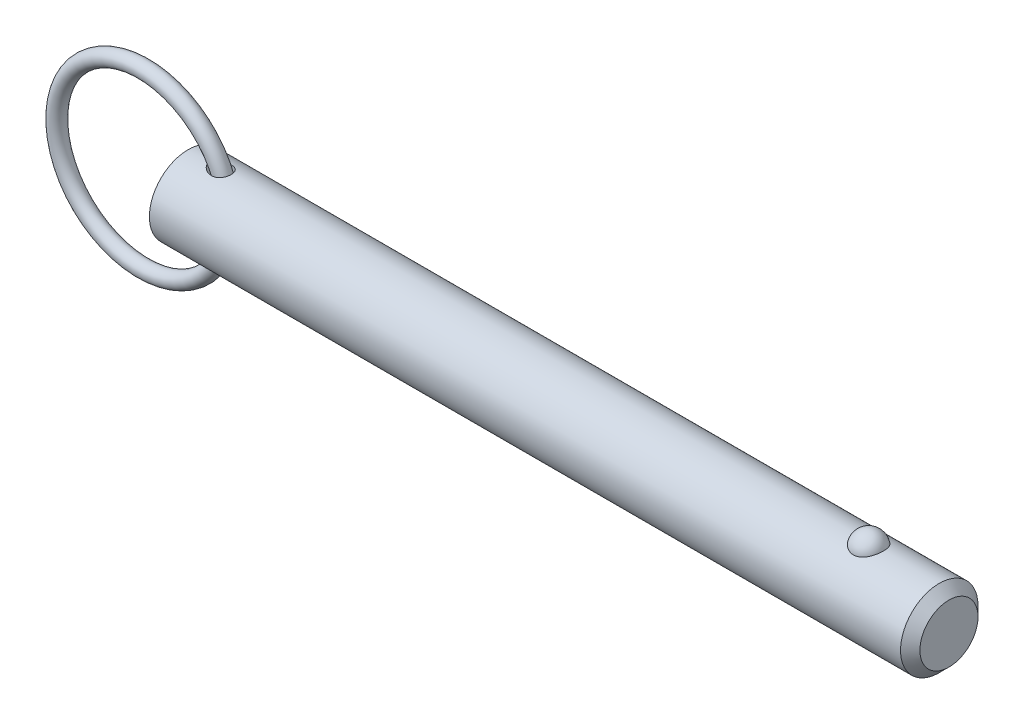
ISO-10303-21;
HEADER;
FILE_DESCRIPTION(('STEP AP214'),'2;1');
FILE_NAME('part.step','',(''),(''),'','','');
FILE_SCHEMA(('AUTOMOTIVE_DESIGN { 1 0 10303 214 1 1 1 1 }'));
ENDSEC;
DATA;
#1=APPLICATION_CONTEXT('core data for automotive mechanical design processes');
#2=APPLICATION_PROTOCOL_DEFINITION('international standard','automotive_design',2000,#1);
#3=PRODUCT_CONTEXT('',#1,'mechanical');
#4=PRODUCT('Part','Part','',(#3));
#5=PRODUCT_RELATED_PRODUCT_CATEGORY('part','',(#4));
#6=PRODUCT_DEFINITION_FORMATION('','',#4);
#7=PRODUCT_DEFINITION_CONTEXT('part definition',#1,'design');
#8=PRODUCT_DEFINITION('design','',#6,#7);
#9=PRODUCT_DEFINITION_SHAPE('','',#8);
#10=(LENGTH_UNIT() NAMED_UNIT(*) SI_UNIT(.MILLI.,.METRE.));
#11=(NAMED_UNIT(*) PLANE_ANGLE_UNIT() SI_UNIT($,.RADIAN.));
#12=(NAMED_UNIT(*) SI_UNIT($,.STERADIAN.) SOLID_ANGLE_UNIT());
#13=UNCERTAINTY_MEASURE_WITH_UNIT(LENGTH_MEASURE(1.E-05),#10,'distance_accuracy_value','');
#14=(GEOMETRIC_REPRESENTATION_CONTEXT(3) GLOBAL_UNCERTAINTY_ASSIGNED_CONTEXT((#13)) GLOBAL_UNIT_ASSIGNED_CONTEXT((#10,
#11,#12)) REPRESENTATION_CONTEXT('',''));
#15=CARTESIAN_POINT('',(0.,0.,0.));
#16=DIRECTION('',(0.,0.,1.));
#17=DIRECTION('',(1.,0.,0.));
#18=AXIS2_PLACEMENT_3D('',#15,#16,#17);
#19=CARTESIAN_POINT('',(-8.23730968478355,0.,0.));
#20=DIRECTION('',(0.,0.,1.));
#21=DIRECTION('',(1.,0.,0.));
#22=AXIS2_PLACEMENT_3D('',#19,#20,#21);
#23=TOROIDAL_SURFACE('',#22,15.875,1.422);
#24=CARTESIAN_POINT('',(9.05969031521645,0.,0.));
#25=VERTEX_POINT('',#24);
#26=VERTEX_LOOP('',#25);
#27=FACE_BOUND('',#26,.T.);
#28=ADVANCED_FACE('P0_F12',(#27),#23,.T.);
#29=CLOSED_SHELL('',(#28));
#30=MANIFOLD_SOLID_BREP('P0_B1',#29);
#31=CARTESIAN_POINT('',(0.,0.,0.));
#32=DIRECTION('',(1.,0.,0.));
#33=DIRECTION('',(0.,0.,-1.));
#34=AXIS2_PLACEMENT_3D('',#31,#32,#33);
#35=CYLINDRICAL_SURFACE('',#34,7.11);
#36=CARTESIAN_POINT('',(3.98467340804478,7.10072679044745,-0.363013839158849));
#37=CARTESIAN_POINT('',(4.00971652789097,7.09600153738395,-0.45539194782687));
#38=CARTESIAN_POINT('',(4.04401947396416,7.08958406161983,-0.545230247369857));
#39=CARTESIAN_POINT('',(4.12810160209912,7.07427055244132,-0.717157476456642));
#40=CARTESIAN_POINT('',(4.17791765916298,7.06536861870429,-0.799227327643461));
#41=CARTESIAN_POINT('',(4.28924471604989,7.04620300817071,-0.953469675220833));
#42=CARTESIAN_POINT('',(4.35063580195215,7.035953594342,-1.02573162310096));
#43=CARTESIAN_POINT('',(4.48282610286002,7.01493313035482,-1.16081412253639));
#44=CARTESIAN_POINT('',(4.55362244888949,7.00416223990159,-1.22363754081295));
#45=CARTESIAN_POINT('',(4.71659336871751,6.98090398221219,-1.35055080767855));
#46=CARTESIAN_POINT('',(4.81029272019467,6.96847103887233,-1.41269256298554));
#47=CARTESIAN_POINT('',(5.0057240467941,6.94515366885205,-1.52319699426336));
#48=CARTESIAN_POINT('',(5.10746392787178,6.93427079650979,-1.57154588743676));
#49=CARTESIAN_POINT('',(5.33503739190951,6.91346066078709,-1.66091325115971));
#50=CARTESIAN_POINT('',(5.46199550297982,6.90402388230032,-1.69921932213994));
#51=CARTESIAN_POINT('',(5.72084799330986,6.89024030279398,-1.75428261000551));
#52=CARTESIAN_POINT('',(5.85274301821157,6.88589416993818,-1.77103699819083));
#53=CARTESIAN_POINT('',(6.11557710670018,6.88337277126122,-1.78081990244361));
#54=CARTESIAN_POINT('',(6.24650031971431,6.88510489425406,-1.77420448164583));
#55=CARTESIAN_POINT('',(6.50446311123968,6.89478744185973,-1.73620392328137));
#56=CARTESIAN_POINT('',(6.6315075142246,6.90272978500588,-1.70485097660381));
#57=CARTESIAN_POINT('',(6.85933269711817,6.92243075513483,-1.62281888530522));
#58=CARTESIAN_POINT('',(6.96133251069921,6.93352131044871,-1.5753580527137));
#59=CARTESIAN_POINT('',(7.15436649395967,6.95824811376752,-1.46226310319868));
#60=CARTESIAN_POINT('',(7.24540699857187,6.97188287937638,-1.3966395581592));
#61=CARTESIAN_POINT('',(7.40446019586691,6.99838217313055,-1.25668991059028));
#62=CARTESIAN_POINT('',(7.473875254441,7.01118308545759,-1.18393777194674));
#63=CARTESIAN_POINT('',(7.59904891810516,7.03582803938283,-1.02736918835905));
#64=CARTESIAN_POINT('',(7.65481029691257,7.04767227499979,-0.943554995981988));
#65=CARTESIAN_POINT('',(7.74982438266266,7.06873077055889,-0.76979592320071));
#66=CARTESIAN_POINT('',(7.7894903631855,7.07800861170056,-0.680084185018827));
#67=CARTESIAN_POINT('',(7.85354088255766,7.09334756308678,-0.495102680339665));
#68=CARTESIAN_POINT('',(7.87792559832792,7.09940871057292,-0.399832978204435));
#69=CARTESIAN_POINT('',(7.9108898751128,7.10766731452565,-0.206294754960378));
#70=CARTESIAN_POINT('',(7.91944662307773,7.10985919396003,-0.108022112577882));
#71=CARTESIAN_POINT('',(7.920501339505,7.11012756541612,0.0886168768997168));
#72=CARTESIAN_POINT('',(7.91299895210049,7.10820396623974,0.186983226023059));
#73=CARTESIAN_POINT('',(7.88205794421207,7.10043733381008,0.381270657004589));
#74=CARTESIAN_POINT('',(7.85857985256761,7.09458459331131,0.477185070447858));
#75=CARTESIAN_POINT('',(7.79617406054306,7.07958431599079,0.663575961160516));
#76=CARTESIAN_POINT('',(7.75724672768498,7.07043685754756,0.754052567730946));
#77=CARTESIAN_POINT('',(7.66496731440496,7.04987259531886,0.926798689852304));
#78=CARTESIAN_POINT('',(7.61164530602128,7.0384605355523,1.00908483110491));
#79=CARTESIAN_POINT('',(7.49191707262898,7.01461776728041,1.16333092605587));
#80=CARTESIAN_POINT('',(7.42551210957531,7.00218715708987,1.235291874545));
#81=CARTESIAN_POINT('',(7.28164031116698,6.97770944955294,1.36680167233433));
#82=CARTESIAN_POINT('',(7.20420170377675,6.96566146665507,1.42638126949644));
#83=CARTESIAN_POINT('',(7.0403906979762,6.94319963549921,1.53199377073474));
#84=CARTESIAN_POINT('',(6.95401827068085,6.93278579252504,1.57802663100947));
#85=CARTESIAN_POINT('',(6.7731858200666,6.91444459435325,1.65656940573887));
#86=CARTESIAN_POINT('',(6.67860569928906,6.90656682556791,1.68881327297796));
#87=CARTESIAN_POINT('',(6.48544119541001,6.89422806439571,1.73849768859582));
#88=CARTESIAN_POINT('',(6.38685561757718,6.88976809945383,1.755933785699));
#89=CARTESIAN_POINT('',(6.18089829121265,6.88429907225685,1.77726234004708));
#90=CARTESIAN_POINT('',(6.07340937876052,6.88356485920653,1.78007646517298));
#91=CARTESIAN_POINT('',(5.85921220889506,6.886086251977,1.77029087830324));
#92=CARTESIAN_POINT('',(5.75250426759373,6.88934339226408,1.75768523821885));
#93=CARTESIAN_POINT('',(5.52848027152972,6.89994454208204,1.71563399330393));
#94=CARTESIAN_POINT('',(5.41155168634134,6.90775772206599,1.68424184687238));
#95=CARTESIAN_POINT('',(5.18376466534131,6.92670168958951,1.60454711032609));
#96=CARTESIAN_POINT('',(5.07291446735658,6.9378368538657,1.5562221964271));
#97=CARTESIAN_POINT('',(4.84835244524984,6.96347168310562,1.43744827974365));
#98=CARTESIAN_POINT('',(4.73562531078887,6.97820486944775,1.36517310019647));
#99=CARTESIAN_POINT('',(4.52504912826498,7.00822340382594,1.20158053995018));
#100=CARTESIAN_POINT('',(4.42717478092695,7.02350775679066,1.11029618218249));
#101=CARTESIAN_POINT('',(4.27935716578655,7.04784659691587,0.940654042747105));
#102=CARTESIAN_POINT('',(4.2239722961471,7.05736064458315,0.867099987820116));
#103=CARTESIAN_POINT('',(4.12558347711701,7.07469854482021,0.711919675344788));
#104=CARTESIAN_POINT('',(4.08256922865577,7.0825238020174,0.630300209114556));
#105=CARTESIAN_POINT('',(4.01142860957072,7.09565978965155,0.459428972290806));
#106=CARTESIAN_POINT('',(3.98346043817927,7.10094374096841,0.370107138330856));
#107=CARTESIAN_POINT('',(3.95517285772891,7.1063173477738,0.233358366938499));
#108=CARTESIAN_POINT('',(3.94802115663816,7.1076831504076,0.187321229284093));
#109=CARTESIAN_POINT('',(3.93842121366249,7.10951900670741,0.0947476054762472));
#110=CARTESIAN_POINT('',(3.93597129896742,7.10998937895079,0.0482113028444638));
#111=CARTESIAN_POINT('',(3.93584361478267,7.11001358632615,-0.0598597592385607));
#112=CARTESIAN_POINT('',(3.9399538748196,7.10922402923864,-0.121405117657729));
#113=CARTESIAN_POINT('',(3.95632793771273,7.10609781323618,-0.243320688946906));
#114=CARTESIAN_POINT('',(3.96859135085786,7.10376122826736,-0.303690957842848));
#115=CARTESIAN_POINT('',(3.98467340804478,7.10072679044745,-0.363013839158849));
#116=B_SPLINE_CURVE_WITH_KNOTS('',3,(#36,#37,#38,#39,#40,#41,#42,#43,#44,#45,#46,#47,#48,#49,
#50,#51,#52,#53,#54,#55,#56,#57,#58,#59,#60,#61,#62,#63,#64,#65,#66,#67,#68,#69,#70,#71,#72,#73,
#74,#75,#76,#77,#78,#79,#80,#81,#82,#83,#84,#85,#86,#87,#88,#89,#90,#91,#92,#93,#94,#95,#96,#97,
#98,#99,#100,#101,#102,#103,#104,#105,#106,#107,#108,#109,#110,#111,#112,#113,#114,#115),
.UNSPECIFIED.,.T.,.F.,(4,2,2,2,2,2,2,2,2,2,2,2,2,2,2,2,2,2,2,2,2,2,2,2,2,2,2,2,2,2,2,2,2,2,2,2,
2,2,2,4),(0.,0.287206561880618,0.575101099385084,0.860162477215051,1.14513709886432,
1.48324846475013,1.82169652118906,2.21865672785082,2.6156690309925,3.00665870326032,
3.39714041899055,3.73437585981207,4.07141541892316,4.37402271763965,4.67656849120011,
4.97076150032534,5.26495110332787,5.55956439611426,5.85418421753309,6.14953461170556,
6.44487798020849,6.73960905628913,7.03431171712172,7.32827352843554,7.6222362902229,
7.9216396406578,8.22113296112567,8.54242840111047,8.86384740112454,9.22635035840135,
9.58933304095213,9.99153142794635,10.3930368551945,10.6697219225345,10.9461759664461,
11.2254825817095,11.3650959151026,11.5046595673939,11.6891051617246,11.8735419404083),.UNSPECIFIED.);
#117=CARTESIAN_POINT('',(3.98467340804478,7.10072679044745,-0.363013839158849));
#118=VERTEX_POINT('',#117);
#119=EDGE_CURVE('P1_E40',#118,#118,#116,.T.);
#120=ORIENTED_EDGE('',*,*,#119,.T.);
#121=EDGE_LOOP('',(#120));
#122=FACE_BOUND('',#121,.T.);
#123=CARTESIAN_POINT('',(137.8925,0.,0.));
#124=DIRECTION('',(1.,0.,0.));
#125=DIRECTION('',(0.,0.,-1.));
#126=AXIS2_PLACEMENT_3D('',#123,#124,#125);
#127=CIRCLE('',#126,7.11);
#128=CARTESIAN_POINT('',(137.8925,0.,-7.11));
#129=VERTEX_POINT('',#128);
#130=EDGE_CURVE('P1_E25',#129,#129,#127,.T.);
#131=ORIENTED_EDGE('',*,*,#130,.F.);
#132=EDGE_LOOP('',(#131));
#133=FACE_BOUND('',#132,.T.);
#134=CARTESIAN_POINT('',(0.,0.,0.));
#135=DIRECTION('',(1.,0.,0.));
#136=DIRECTION('',(0.,0.,-1.));
#137=AXIS2_PLACEMENT_3D('',#134,#135,#136);
#138=CIRCLE('',#137,7.11);
#139=CARTESIAN_POINT('',(0.,0.,-7.11));
#140=VERTEX_POINT('',#139);
#141=EDGE_CURVE('P1_E9',#140,#140,#138,.T.);
#142=ORIENTED_EDGE('',*,*,#141,.T.);
#143=EDGE_LOOP('',(#142));
#144=FACE_BOUND('',#143,.T.);
#145=CARTESIAN_POINT('',(124.929258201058,6.5364666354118,2.79762469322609));
#146=CARTESIAN_POINT('',(124.784429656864,6.53647876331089,2.79761243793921));
#147=CARTESIAN_POINT('',(124.639368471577,6.54144531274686,2.78608115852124));
#148=CARTESIAN_POINT('',(124.353292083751,6.56077791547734,2.7402328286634));
#149=CARTESIAN_POINT('',(124.212288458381,6.5751685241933,2.7058562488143));
#150=CARTESIAN_POINT('',(123.93888335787,6.61165072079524,2.61544042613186));
#151=CARTESIAN_POINT('',(123.806460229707,6.63372195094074,2.55945840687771));
#152=CARTESIAN_POINT('',(123.553233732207,6.68316012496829,2.42742958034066));
#153=CARTESIAN_POINT('',(123.432425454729,6.71052481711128,2.35139129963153));
#154=CARTESIAN_POINT('',(123.201637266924,6.76860821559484,2.17866150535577));
#155=CARTESIAN_POINT('',(123.092085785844,6.79940242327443,2.0814234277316));
#156=CARTESIAN_POINT('',(122.89033404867,6.86050242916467,1.87020907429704));
#157=CARTESIAN_POINT('',(122.798139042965,6.89080807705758,1.75622775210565));
#158=CARTESIAN_POINT('',(122.62925478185,6.94923069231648,1.50900646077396));
#159=CARTESIAN_POINT('',(122.553428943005,6.97719213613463,1.37513873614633));
#160=CARTESIAN_POINT('',(122.424206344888,7.02647251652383,1.09584817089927));
#161=CARTESIAN_POINT('',(122.370810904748,7.04779106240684,0.95042465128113));
#162=CARTESIAN_POINT('',(122.287101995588,7.08180248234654,0.650508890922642));
#163=CARTESIAN_POINT('',(122.257025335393,7.09440672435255,0.495940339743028));
#164=CARTESIAN_POINT('',(122.221473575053,7.10935121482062,0.183515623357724));
#165=CARTESIAN_POINT('',(122.215997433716,7.11169189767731,0.0256595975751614));
#166=CARTESIAN_POINT('',(122.229700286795,7.10589702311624,-0.28751219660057));
#167=CARTESIAN_POINT('',(122.24868231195,7.0978451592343,-0.442838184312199));
#168=CARTESIAN_POINT('',(122.31057450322,7.07221860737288,-0.747830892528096));
#169=CARTESIAN_POINT('',(122.353485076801,7.05464375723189,-0.897497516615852));
#170=CARTESIAN_POINT('',(122.462452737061,7.01171031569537,-1.18722864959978));
#171=CARTESIAN_POINT('',(122.528545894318,6.98633960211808,-1.32727778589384));
#172=CARTESIAN_POINT('',(122.682536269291,6.93042258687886,-1.59370324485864));
#173=CARTESIAN_POINT('',(122.770435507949,6.89987580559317,-1.72007829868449));
#174=CARTESIAN_POINT('',(122.966926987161,6.83659510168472,-1.95657345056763));
#175=CARTESIAN_POINT('',(123.075664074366,6.80384697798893,-2.06656957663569));
#176=CARTESIAN_POINT('',(123.310968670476,6.74001831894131,-2.26611005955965));
#177=CARTESIAN_POINT('',(123.437535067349,6.70893767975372,-2.35565569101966));
#178=CARTESIAN_POINT('',(123.702845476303,6.65264442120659,-2.51019726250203));
#179=CARTESIAN_POINT('',(123.841323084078,6.62733449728,-2.57561395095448));
#180=CARTESIAN_POINT('',(124.128519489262,6.58495995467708,-2.68211134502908));
#181=CARTESIAN_POINT('',(124.277234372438,6.56789220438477,-2.7232012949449));
#182=CARTESIAN_POINT('',(124.572626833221,6.54478663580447,-2.77825810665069));
#183=CARTESIAN_POINT('',(124.71902951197,6.53823639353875,-2.79348727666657));
#184=CARTESIAN_POINT('',(125.012470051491,6.53532718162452,-2.80028921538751));
#185=CARTESIAN_POINT('',(125.159507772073,6.53896606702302,-2.79186696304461));
#186=CARTESIAN_POINT('',(125.444921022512,6.55570357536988,-2.75232178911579));
#187=CARTESIAN_POINT('',(125.583422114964,6.56848455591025,-2.72196077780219));
#188=CARTESIAN_POINT('',(125.853114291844,6.60173528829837,-2.64028774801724));
#189=CARTESIAN_POINT('',(125.984304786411,6.62220565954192,-2.58897404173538));
#190=CARTESIAN_POINT('',(126.238846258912,6.66917927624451,-2.4654782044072));
#191=CARTESIAN_POINT('',(126.361969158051,6.69580233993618,-2.39287266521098));
#192=CARTESIAN_POINT('',(126.594441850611,6.75207041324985,-2.2291526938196));
#193=CARTESIAN_POINT('',(126.703788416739,6.78171612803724,-2.13803393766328));
#194=CARTESIAN_POINT('',(126.911642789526,6.84264629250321,-1.93445592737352));
#195=CARTESIAN_POINT('',(127.009317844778,6.87393748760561,-1.82114774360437));
#196=CARTESIAN_POINT('',(127.185011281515,6.93345710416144,-1.57947787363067));
#197=CARTESIAN_POINT('',(127.263026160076,6.96168497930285,-1.45111351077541));
#198=CARTESIAN_POINT('',(127.399985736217,7.01307558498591,-1.17842708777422));
#199=CARTESIAN_POINT('',(127.458258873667,7.03605262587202,-1.03373189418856));
#200=CARTESIAN_POINT('',(127.551081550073,7.07340932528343,-0.735867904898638));
#201=CARTESIAN_POINT('',(127.585631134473,7.08778900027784,-0.58269912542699));
#202=CARTESIAN_POINT('',(127.630274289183,7.10647639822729,-0.272420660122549));
#203=CARTESIAN_POINT('',(127.64039710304,7.11079616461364,-0.115315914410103));
#204=CARTESIAN_POINT('',(127.636061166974,7.10896059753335,0.198488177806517));
#205=CARTESIAN_POINT('',(127.621603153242,7.10280557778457,0.35518753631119));
#206=CARTESIAN_POINT('',(127.568572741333,7.08071500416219,0.662724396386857));
#207=CARTESIAN_POINT('',(127.53015058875,7.06484039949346,0.813592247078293));
#208=CARTESIAN_POINT('',(127.430101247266,7.0249589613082,1.10629159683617));
#209=CARTESIAN_POINT('',(127.368472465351,7.00095156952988,1.24812247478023));
#210=CARTESIAN_POINT('',(127.222766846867,6.94706632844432,1.51976439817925));
#211=CARTESIAN_POINT('',(127.138544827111,6.91715085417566,1.64949012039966));
#212=CARTESIAN_POINT('',(126.949586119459,6.8547056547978,1.89231285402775));
#213=CARTESIAN_POINT('',(126.844850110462,6.82217601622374,2.00541041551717));
#214=CARTESIAN_POINT('',(126.617103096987,6.75805358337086,2.21190674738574));
#215=CARTESIAN_POINT('',(126.494082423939,6.72646129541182,2.30529503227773));
#216=CARTESIAN_POINT('',(126.23273470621,6.66789520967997,2.46959908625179));
#217=CARTESIAN_POINT('',(126.094401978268,6.64092313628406,2.54050647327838));
#218=CARTESIAN_POINT('',(125.811182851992,6.59572583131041,2.65560045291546));
#219=CARTESIAN_POINT('',(125.666666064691,6.57724013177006,2.70059539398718));
#220=CARTESIAN_POINT('',(125.371546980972,6.55006426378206,2.76587321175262));
#221=CARTESIAN_POINT('',(125.220964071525,6.54134511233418,2.78622922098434));
#222=CARTESIAN_POINT('',(125.023046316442,6.53697847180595,2.7964243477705));
#223=CARTESIAN_POINT('',(124.976164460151,6.53646270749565,2.79762866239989));
#224=CARTESIAN_POINT('',(124.929258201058,6.5364666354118,2.79762469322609));
#225=B_SPLINE_CURVE_WITH_KNOTS('',3,(#145,#146,#147,#148,#149,#150,#151,#152,#153,#154,#155,
#156,#157,#158,#159,#160,#161,#162,#163,#164,#165,#166,#167,#168,#169,#170,#171,#172,#173,#174,
#175,#176,#177,#178,#179,#180,#181,#182,#183,#184,#185,#186,#187,#188,#189,#190,#191,#192,#193,
#194,#195,#196,#197,#198,#199,#200,#201,#202,#203,#204,#205,#206,#207,#208,#209,#210,#211,#212,
#213,#214,#215,#216,#217,#218,#219,#220,#221,#222,#223,#224),.UNSPECIFIED.,.T.,.F.,(4,2,2,2,2,2,
2,2,2,2,2,2,2,2,2,2,2,2,2,2,2,2,2,2,2,2,2,2,2,2,2,2,2,2,2,2,2,2,2,4),(0.,0.434355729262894,
0.869847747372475,1.30419416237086,1.73835621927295,2.18541922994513,2.63261726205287,
3.09954261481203,3.56649542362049,4.03813031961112,4.5097452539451,4.97758575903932,
5.44543423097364,5.91401389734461,6.38263700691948,6.85464418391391,7.32662193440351,
7.78992971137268,8.25306131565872,8.69285754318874,9.13256119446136,9.5576862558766,
9.98284556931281,10.4171106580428,10.8514772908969,11.3079089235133,11.7644218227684,
12.2351898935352,12.7059570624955,13.1761603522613,13.6463495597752,14.1136200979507,
14.580922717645,15.0513032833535,15.5216682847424,15.9922828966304,16.4630727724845,
16.9182457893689,17.372064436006,17.5127411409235),.UNSPECIFIED.);
#226=CARTESIAN_POINT('',(124.929258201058,6.5364666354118,2.79762469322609));
#227=VERTEX_POINT('',#226);
#228=EDGE_CURVE('P1_E34',#227,#227,#225,.T.);
#229=ORIENTED_EDGE('',*,*,#228,.T.);
#230=EDGE_LOOP('',(#229));
#231=FACE_BOUND('',#230,.T.);
#232=CARTESIAN_POINT('',(3.98467340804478,-7.10072679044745,-0.363013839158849));
#233=CARTESIAN_POINT('',(3.96426456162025,-7.10457733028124,-0.287714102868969));
#234=CARTESIAN_POINT('',(3.95000501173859,-7.10730349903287,-0.210695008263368));
#235=CARTESIAN_POINT('',(3.93481801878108,-7.11020840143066,-0.0553038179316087));
#236=CARTESIAN_POINT('',(3.93388435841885,-7.11038832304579,0.0230676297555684));
#237=CARTESIAN_POINT('',(3.94541910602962,-7.10817995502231,0.178714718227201));
#238=CARTESIAN_POINT('',(3.95787987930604,-7.10579312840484,0.25599095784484));
#239=CARTESIAN_POINT('',(3.99523775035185,-7.09872642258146,0.407352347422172));
#240=CARTESIAN_POINT('',(4.02014065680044,-7.09404547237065,0.481435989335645));
#241=CARTESIAN_POINT('',(4.08119600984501,-7.08278363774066,0.625775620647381));
#242=CARTESIAN_POINT('',(4.11749458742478,-7.07617815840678,0.695967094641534));
#243=CARTESIAN_POINT('',(4.19940836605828,-7.06165305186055,0.830508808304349));
#244=CARTESIAN_POINT('',(4.24502952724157,-7.0537325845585,0.894855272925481));
#245=CARTESIAN_POINT('',(4.36790232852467,-7.03310314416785,1.04688574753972));
#246=CARTESIAN_POINT('',(4.44977459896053,-7.01993229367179,1.13078695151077));
#247=CARTESIAN_POINT('',(4.62610796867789,-6.99351259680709,1.28411726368));
#248=CARTESIAN_POINT('',(4.7205898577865,-6.98026365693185,1.35352197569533));
#249=CARTESIAN_POINT('',(4.92036507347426,-6.9549104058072,1.47831921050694));
#250=CARTESIAN_POINT('',(5.02579054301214,-6.94282458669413,1.53350332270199));
#251=CARTESIAN_POINT('',(5.24378330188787,-6.92129098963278,1.62793610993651));
#252=CARTESIAN_POINT('',(5.35635066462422,-6.91184323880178,1.66718462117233));
#253=CARTESIAN_POINT('',(5.60134354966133,-6.89573491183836,1.73269893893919));
#254=CARTESIAN_POINT('',(5.73444697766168,-6.8895970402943,1.75661057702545));
#255=CARTESIAN_POINT('',(6.00300738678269,-6.88344616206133,1.78057487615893));
#256=CARTESIAN_POINT('',(6.13846360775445,-6.88343121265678,1.78063510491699));
#257=CARTESIAN_POINT('',(6.39660470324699,-6.88981379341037,1.75576480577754));
#258=CARTESIAN_POINT('',(6.51947843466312,-6.89572457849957,1.73273121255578));
#259=CARTESIAN_POINT('',(6.75813770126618,-6.91274434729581,1.66352936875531));
#260=CARTESIAN_POINT('',(6.87393155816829,-6.92384709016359,1.61738888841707));
#261=CARTESIAN_POINT('',(7.07801861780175,-6.94787316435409,1.51052664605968));
#262=CARTESIAN_POINT('',(7.16789841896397,-6.96033024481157,1.45271574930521));
#263=CARTESIAN_POINT('',(7.33546773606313,-6.98638661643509,1.32171912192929));
#264=CARTESIAN_POINT('',(7.41316182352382,-6.99998547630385,1.24853918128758));
#265=CARTESIAN_POINT('',(7.54861420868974,-7.02559503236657,1.09486170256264));
#266=CARTESIAN_POINT('',(7.60741145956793,-7.03764930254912,1.01528346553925));
#267=CARTESIAN_POINT('',(7.71070740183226,-7.0598657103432,0.847099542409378));
#268=CARTESIAN_POINT('',(7.75520788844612,-7.0700280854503,0.758494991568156));
#269=CARTESIAN_POINT('',(7.82836147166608,-7.08722075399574,0.575936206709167));
#270=CARTESIAN_POINT('',(7.85719783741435,-7.09428707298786,0.482058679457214));
#271=CARTESIAN_POINT('',(7.89918378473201,-7.10470260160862,0.29065874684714));
#272=CARTESIAN_POINT('',(7.91233308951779,-7.10805174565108,0.193136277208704));
#273=CARTESIAN_POINT('',(7.92267451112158,-7.11067890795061,-0.00313968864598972));
#274=CARTESIAN_POINT('',(7.91981203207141,-7.10994299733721,-0.10189624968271));
#275=CARTESIAN_POINT('',(7.89806489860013,-7.10444651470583,-0.297516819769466));
#276=CARTESIAN_POINT('',(7.87918005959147,-7.09968589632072,-0.394380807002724));
#277=CARTESIAN_POINT('',(7.82577988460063,-7.0866471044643,-0.58355375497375));
#278=CARTESIAN_POINT('',(7.79124976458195,-7.07836560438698,-0.675858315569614));
#279=CARTESIAN_POINT('',(7.70736343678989,-7.05919003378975,-0.853167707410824));
#280=CARTESIAN_POINT('',(7.65800801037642,-7.04829610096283,-0.938172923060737));
#281=CARTESIAN_POINT('',(7.54590141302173,-7.02513961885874,-1.09819812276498));
#282=CARTESIAN_POINT('',(7.48319521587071,-7.01288172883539,-1.17325029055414));
#283=CARTESIAN_POINT('',(7.34599775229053,-6.98832192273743,-1.31164333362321));
#284=CARTESIAN_POINT('',(7.27150757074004,-6.97602001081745,-1.37498528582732));
#285=CARTESIAN_POINT('',(7.11277776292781,-6.95268608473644,-1.48849974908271));
#286=CARTESIAN_POINT('',(7.02852525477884,-6.94165578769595,-1.53865456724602));
#287=CARTESIAN_POINT('',(6.85282430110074,-6.92200320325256,-1.62478650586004));
#288=CARTESIAN_POINT('',(6.76137511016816,-6.91338116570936,-1.66076215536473));
#289=CARTESIAN_POINT('',(6.57061179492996,-6.89906044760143,-1.71930563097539));
#290=CARTESIAN_POINT('',(6.47113516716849,-6.89347290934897,-1.74136795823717));
#291=CARTESIAN_POINT('',(6.26989833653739,-6.88605020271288,-1.7704895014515));
#292=CARTESIAN_POINT('',(6.16813737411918,-6.88421630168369,-1.77754365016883));
#293=CARTESIAN_POINT('',(5.95492537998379,-6.88424071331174,-1.77745174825));
#294=CARTESIAN_POINT('',(5.8434768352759,-6.88646827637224,-1.76888555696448));
#295=CARTESIAN_POINT('',(5.62307560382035,-6.89483827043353,-1.73596677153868));
#296=CARTESIAN_POINT('',(5.51412477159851,-6.90098351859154,-1.71160281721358));
#297=CARTESIAN_POINT('',(5.28644478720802,-6.91743803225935,-1.64393691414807));
#298=CARTESIAN_POINT('',(5.16837217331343,-6.92819628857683,-1.59852806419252));
#299=CARTESIAN_POINT('',(4.94091825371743,-6.95234836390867,-1.4899796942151));
#300=CARTESIAN_POINT('',(4.83153887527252,-6.96574276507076,-1.42683625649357));
#301=CARTESIAN_POINT('',(4.63576710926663,-6.99209234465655,-1.29112257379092));
#302=CARTESIAN_POINT('',(4.54816728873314,-7.00494184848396,-1.22027748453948));
#303=CARTESIAN_POINT('',(4.38554897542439,-7.03019055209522,-1.0652111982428));
#304=CARTESIAN_POINT('',(4.31052141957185,-7.04259007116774,-0.980999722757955));
#305=CARTESIAN_POINT('',(4.18551811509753,-7.0640229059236,-0.811206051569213));
#306=CARTESIAN_POINT('',(4.13358417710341,-7.07328321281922,-0.727107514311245));
#307=CARTESIAN_POINT('',(4.04607461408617,-7.0891994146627,-0.550580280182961));
#308=CARTESIAN_POINT('',(4.01046401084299,-7.09586087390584,-0.458169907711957));
#309=CARTESIAN_POINT('',(3.98467340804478,-7.10072679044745,-0.363013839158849));
#310=B_SPLINE_CURVE_WITH_KNOTS('',3,(#232,#233,#234,#235,#236,#237,#238,#239,#240,#241,#242,
#243,#244,#245,#246,#247,#248,#249,#250,#251,#252,#253,#254,#255,#256,#257,#258,#259,#260,#261,
#262,#263,#264,#265,#266,#267,#268,#269,#270,#271,#272,#273,#274,#275,#276,#277,#278,#279,#280,
#281,#282,#283,#284,#285,#286,#287,#288,#289,#290,#291,#292,#293,#294,#295,#296,#297,#298,#299,
#300,#301,#302,#303,#304,#305,#306,#307,#308,#309),.UNSPECIFIED.,.T.,.F.,(4,2,2,2,2,2,2,2,2,2,2,
2,2,2,2,2,2,2,2,2,2,2,2,2,2,2,2,2,2,2,2,2,2,2,2,2,2,2,4),(0.,0.23402065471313,0.467932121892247,
0.701710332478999,0.935597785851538,1.17261620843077,1.40978663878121,1.76177576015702,
2.11435255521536,2.47183528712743,2.8293216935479,3.23332937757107,3.63720887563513,
4.01042610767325,4.38319587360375,4.70425151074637,5.02518641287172,5.32277979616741,
5.62033579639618,5.91433101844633,6.2083314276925,6.50333490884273,6.79834178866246,
7.09362801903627,7.38889868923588,7.6831900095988,7.9774542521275,8.27211131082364,
8.56679892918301,8.8716552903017,9.17661456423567,9.51069129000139,9.84500851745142,
10.2243046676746,10.6036846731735,10.9425776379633,11.2812252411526,11.5775945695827,
11.8733258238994),.UNSPECIFIED.);
#311=CARTESIAN_POINT('',(3.98467340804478,-7.10072679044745,-0.363013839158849));
#312=VERTEX_POINT('',#311);
#313=EDGE_CURVE('P1_E17',#312,#312,#310,.T.);
#314=ORIENTED_EDGE('',*,*,#313,.T.);
#315=EDGE_LOOP('',(#314));
#316=FACE_BOUND('',#315,.T.);
#317=ADVANCED_FACE('P1_F13',(#122,#133,#144,#231,#316),#35,.T.);
#318=CARTESIAN_POINT('',(0.,0.,0.));
#319=DIRECTION('',(-1.,0.,0.));
#320=DIRECTION('',(0.,0.,1.));
#321=AXIS2_PLACEMENT_3D('',#318,#319,#320);
#322=PLANE('',#321);
#323=ORIENTED_EDGE('',*,*,#141,.F.);
#324=EDGE_LOOP('',(#323));
#325=FACE_BOUND('',#324,.T.);
#326=ADVANCED_FACE('P1_F15',(#325),#322,.T.);
#327=CARTESIAN_POINT('',(139.67,0.,0.));
#328=DIRECTION('',(-1.,0.,0.));
#329=DIRECTION('',(0.,0.,1.));
#330=AXIS2_PLACEMENT_3D('',#327,#328,#329);
#331=CONICAL_SURFACE('',#330,5.33250000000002,0.785398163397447);
#332=ORIENTED_EDGE('',*,*,#130,.T.);
#333=EDGE_LOOP('',(#332));
#334=FACE_BOUND('',#333,.T.);
#335=CARTESIAN_POINT('',(139.67,0.,0.));
#336=DIRECTION('',(1.,0.,0.));
#337=DIRECTION('',(0.,0.,-1.));
#338=AXIS2_PLACEMENT_3D('',#335,#336,#337);
#339=CIRCLE('',#338,5.33250000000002);
#340=CARTESIAN_POINT('',(139.67,0.,-5.33250000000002));
#341=VERTEX_POINT('',#340);
#342=EDGE_CURVE('P1_E30',#341,#341,#339,.T.);
#343=ORIENTED_EDGE('',*,*,#342,.F.);
#344=EDGE_LOOP('',(#343));
#345=FACE_BOUND('',#344,.T.);
#346=ADVANCED_FACE('P1_F55',(#334,#345),#331,.T.);
#347=CARTESIAN_POINT('',(139.67,5.33250000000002,0.));
#348=DIRECTION('',(1.,0.,0.));
#349=DIRECTION('',(0.,0.,-1.));
#350=AXIS2_PLACEMENT_3D('',#347,#348,#349);
#351=PLANE('',#350);
#352=ORIENTED_EDGE('',*,*,#342,.T.);
#353=EDGE_LOOP('',(#352));
#354=FACE_BOUND('',#353,.T.);
#355=ADVANCED_FACE('P1_F51',(#354),#351,.T.);
#356=CARTESIAN_POINT('',(124.929258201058,6.399,0.));
#357=DIRECTION('',(-1.,0.,0.));
#358=DIRECTION('',(0.,1.,0.));
#359=AXIS2_PLACEMENT_3D('',#356,#357,#358);
#360=SPHERICAL_SURFACE('',#359,2.80099999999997);
#361=ORIENTED_EDGE('',*,*,#228,.F.);
#362=EDGE_LOOP('',(#361));
#363=FACE_BOUND('',#362,.T.);
#364=ADVANCED_FACE('P1_F46',(#363),#360,.T.);
#365=CARTESIAN_POINT('',(-8.23730968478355,0.,0.));
#366=DIRECTION('',(0.,0.,1.));
#367=DIRECTION('',(1.,0.,0.));
#368=AXIS2_PLACEMENT_3D('',#365,#366,#367);
#369=TOROIDAL_SURFACE('',#368,15.875,1.7775);
#370=ORIENTED_EDGE('',*,*,#313,.F.);
#371=EDGE_LOOP('',(#370));
#372=FACE_BOUND('',#371,.T.);
#373=ORIENTED_EDGE('',*,*,#119,.F.);
#374=EDGE_LOOP('',(#373));
#375=FACE_BOUND('',#374,.T.);
#376=ADVANCED_FACE('P1_F50',(#372,#375),#369,.F.);
#377=CLOSED_SHELL('',(#317,#326,#346,#355,#364,#376));
#378=MANIFOLD_SOLID_BREP('P1_B1',#377);
#379=ADVANCED_BREP_SHAPE_REPRESENTATION('',(#18,#30,#378),#14);
#380=SHAPE_DEFINITION_REPRESENTATION(#9,#379);
ENDSEC;
END-ISO-10303-21;
